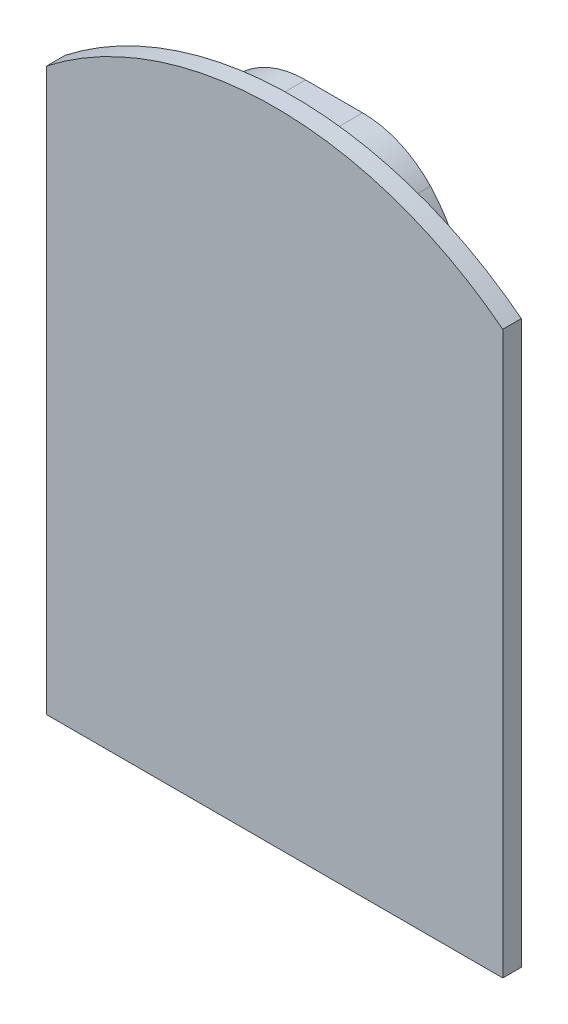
from build123d import *

# Parameters (mm, degrees)
BOSS_EXTRUDE1_DEPTH = 1
SKETCH2_R           = 7.1
SKETCH2_R_2         = 6.1
BOSS_EXTRUDE2_DEPTH = 2.2
FILLET1_R           = 5


with BuildPart() as part:
    # Sketch1 → Boss-Extrude1 (new body)
    with BuildSketch(Plane.XY):
        with BuildLine():
            Line((0, 0), (0, -30.3))
            Line((0, -30.3), (24.6, -30.3))
            Line((24.6, -30.3), (24.6, 0))
            ThreePointArc((24.6, 0), (12.3, 4.229457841), (0, 0))
        make_face()
    extrude(amount=BOSS_EXTRUDE1_DEPTH)

    # Sketch2 → Boss-Extrude2 (add)
    # profile 1 of 2: a face of its own
    with BuildSketch(Plane(origin=(0, 0, 0), x_dir=(-1, 0, 0), z_dir=(0, 0, -1))):
        with Locations((-12.3, -21.3)):
            Circle(SKETCH2_R)
        with Locations((-12.3, -21.3)):
            Circle(SKETCH2_R_2, mode=Mode.SUBTRACT)
    # profile 2 of 2: a face of its own
    with BuildSketch(Plane(origin=(0, 0, 0), x_dir=(-1, 0, 0), z_dir=(0, 0, -1))):
        with BuildLine():
            Line((-15.311988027, 3.129457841), (-9.288011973, 3.129457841))
            ThreePointArc((-9.288011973, 3.129457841), (-12.3, -10.4), (-15.311988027, 3.129457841))
        make_face()
        with Locations((-12.3, -3.3)):
            Circle(SKETCH2_R_2, mode=Mode.SUBTRACT)
    extrude(amount=BOSS_EXTRUDE2_DEPTH)

    # Fillet1
    fillet1_edges = [part.edges().sort_by_distance(p)[0] for p in [
        (15.311988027, 3.129457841, -1.1),
        (9.288011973, 3.129457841, -1.1),
    ]]
    fillet(fillet1_edges, radius=FILLET1_R)


solid = part.part
